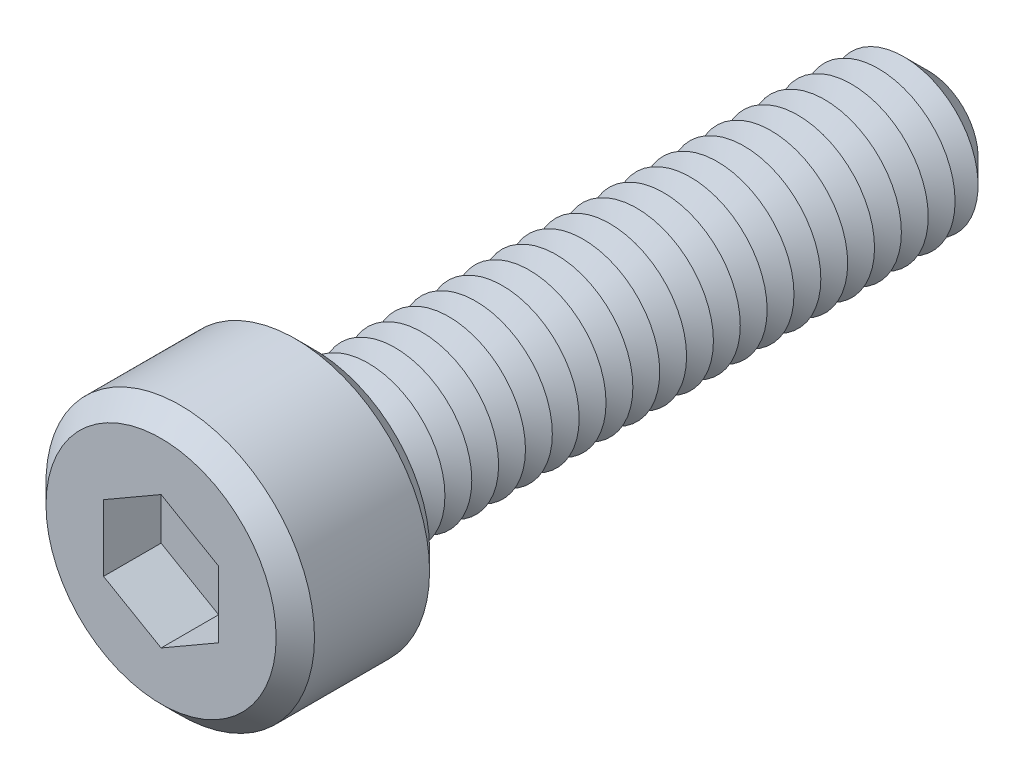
ISO-10303-21;
HEADER;
FILE_DESCRIPTION(('STEP AP214'),'2;1');
FILE_NAME('part.step','',(''),(''),'','','');
FILE_SCHEMA(('AUTOMOTIVE_DESIGN { 1 0 10303 214 1 1 1 1 }'));
ENDSEC;
DATA;
#1=APPLICATION_CONTEXT('core data for automotive mechanical design processes');
#2=APPLICATION_PROTOCOL_DEFINITION('international standard','automotive_design',2000,#1);
#3=PRODUCT_CONTEXT('',#1,'mechanical');
#4=PRODUCT('Part','Part','',(#3));
#5=PRODUCT_RELATED_PRODUCT_CATEGORY('part','',(#4));
#6=PRODUCT_DEFINITION_FORMATION('','',#4);
#7=PRODUCT_DEFINITION_CONTEXT('part definition',#1,'design');
#8=PRODUCT_DEFINITION('design','',#6,#7);
#9=PRODUCT_DEFINITION_SHAPE('','',#8);
#10=(LENGTH_UNIT() NAMED_UNIT(*) SI_UNIT(.MILLI.,.METRE.));
#11=(NAMED_UNIT(*) PLANE_ANGLE_UNIT() SI_UNIT($,.RADIAN.));
#12=(NAMED_UNIT(*) SI_UNIT($,.STERADIAN.) SOLID_ANGLE_UNIT());
#13=UNCERTAINTY_MEASURE_WITH_UNIT(LENGTH_MEASURE(1.E-05),#10,'distance_accuracy_value','');
#14=(GEOMETRIC_REPRESENTATION_CONTEXT(3) GLOBAL_UNCERTAINTY_ASSIGNED_CONTEXT((#13)) GLOBAL_UNIT_ASSIGNED_CONTEXT((#10,
#11,#12)) REPRESENTATION_CONTEXT('',''));
#15=CARTESIAN_POINT('',(0.,0.,0.));
#16=DIRECTION('',(0.,0.,1.));
#17=DIRECTION('',(1.,0.,0.));
#18=AXIS2_PLACEMENT_3D('',#15,#16,#17);
#19=CARTESIAN_POINT('',(0.,0.,4.));
#20=DIRECTION('',(0.,0.,-1.));
#21=DIRECTION('',(-1.,0.,0.));
#22=AXIS2_PLACEMENT_3D('',#19,#20,#21);
#23=CYLINDRICAL_SURFACE('',#22,3.5);
#24=CARTESIAN_POINT('',(0.,0.,0.5));
#25=DIRECTION('',(0.,0.,1.));
#26=DIRECTION('',(1.,0.,0.));
#27=AXIS2_PLACEMENT_3D('',#24,#25,#26);
#28=CIRCLE('',#27,3.5);
#29=CARTESIAN_POINT('',(3.5,0.,0.5));
#30=VERTEX_POINT('',#29);
#31=EDGE_CURVE('E352',#30,#30,#28,.T.);
#32=ORIENTED_EDGE('',*,*,#31,.T.);
#33=EDGE_LOOP('',(#32));
#34=FACE_BOUND('',#33,.T.);
#35=CARTESIAN_POINT('',(0.,0.,3.5));
#36=DIRECTION('',(0.,0.,1.));
#37=DIRECTION('',(1.,0.,0.));
#38=AXIS2_PLACEMENT_3D('',#35,#36,#37);
#39=CIRCLE('',#38,3.5);
#40=CARTESIAN_POINT('',(3.5,0.,3.5));
#41=VERTEX_POINT('',#40);
#42=EDGE_CURVE('E345',#41,#41,#39,.F.);
#43=ORIENTED_EDGE('',*,*,#42,.T.);
#44=EDGE_LOOP('',(#43));
#45=FACE_BOUND('',#44,.T.);
#46=ADVANCED_FACE('F39',(#34,#45),#23,.T.);
#47=CARTESIAN_POINT('',(0.,0.,4.));
#48=DIRECTION('',(0.,0.,1.));
#49=DIRECTION('',(1.,0.,0.));
#50=AXIS2_PLACEMENT_3D('',#47,#48,#49);
#51=PLANE('',#50);
#52=CARTESIAN_POINT('',(0.,0.,4.));
#53=DIRECTION('',(0.,0.,1.));
#54=DIRECTION('',(1.,0.,0.));
#55=AXIS2_PLACEMENT_3D('',#52,#53,#54);
#56=CIRCLE('',#55,3.);
#57=CARTESIAN_POINT('',(3.,0.,4.));
#58=VERTEX_POINT('',#57);
#59=EDGE_CURVE('E11',#58,#58,#56,.T.);
#60=ORIENTED_EDGE('',*,*,#59,.T.);
#61=EDGE_LOOP('',(#60));
#62=FACE_BOUND('',#61,.T.);
#63=DIRECTION('',(-0.866025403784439,0.5,0.));
#64=VECTOR('',#63,1.);
#65=CARTESIAN_POINT('',(1.5,0.866025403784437,4.));
#66=LINE('',#65,#64);
#67=CARTESIAN_POINT('',(1.5,0.866025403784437,4.));
#68=VERTEX_POINT('',#67);
#69=CARTESIAN_POINT('',(0.,1.73205080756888,4.));
#70=VERTEX_POINT('',#69);
#71=EDGE_CURVE('E55',#68,#70,#66,.T.);
#72=ORIENTED_EDGE('',*,*,#71,.F.);
#73=DIRECTION('',(0.,1.,0.));
#74=VECTOR('',#73,1.);
#75=CARTESIAN_POINT('',(1.5,-0.866025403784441,4.));
#76=LINE('',#75,#74);
#77=CARTESIAN_POINT('',(1.5,-0.866025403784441,4.));
#78=VERTEX_POINT('',#77);
#79=EDGE_CURVE('E151',#78,#68,#76,.T.);
#80=ORIENTED_EDGE('',*,*,#79,.F.);
#81=DIRECTION('',(0.866025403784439,0.5,0.));
#82=VECTOR('',#81,1.);
#83=CARTESIAN_POINT('',(0.,-1.73205080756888,4.));
#84=LINE('',#83,#82);
#85=CARTESIAN_POINT('',(0.,-1.73205080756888,4.));
#86=VERTEX_POINT('',#85);
#87=EDGE_CURVE('E148',#86,#78,#84,.T.);
#88=ORIENTED_EDGE('',*,*,#87,.F.);
#89=DIRECTION('',(0.866025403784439,-0.5,0.));
#90=VECTOR('',#89,1.);
#91=CARTESIAN_POINT('',(-1.5,-0.86602540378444,4.));
#92=LINE('',#91,#90);
#93=CARTESIAN_POINT('',(-1.5,-0.86602540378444,4.));
#94=VERTEX_POINT('',#93);
#95=EDGE_CURVE('E103',#94,#86,#92,.T.);
#96=ORIENTED_EDGE('',*,*,#95,.F.);
#97=DIRECTION('',(0.,-1.,0.));
#98=VECTOR('',#97,1.);
#99=CARTESIAN_POINT('',(-1.5,0.866025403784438,4.));
#100=LINE('',#99,#98);
#101=CARTESIAN_POINT('',(-1.5,0.866025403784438,4.));
#102=VERTEX_POINT('',#101);
#103=EDGE_CURVE('E142',#102,#94,#100,.T.);
#104=ORIENTED_EDGE('',*,*,#103,.F.);
#105=DIRECTION('',(-0.866025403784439,-0.5,0.));
#106=VECTOR('',#105,1.);
#107=CARTESIAN_POINT('',(0.,1.73205080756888,4.));
#108=LINE('',#107,#106);
#109=EDGE_CURVE('E137',#70,#102,#108,.T.);
#110=ORIENTED_EDGE('',*,*,#109,.F.);
#111=EDGE_LOOP('',(#72,#80,#88,#96,#104,#110));
#112=FACE_BOUND('',#111,.T.);
#113=ADVANCED_FACE('F370',(#62,#112),#51,.T.);
#114=CARTESIAN_POINT('',(0.,0.,0.));
#115=DIRECTION('',(0.,0.,1.));
#116=DIRECTION('',(1.,0.,0.));
#117=AXIS2_PLACEMENT_3D('',#114,#115,#116);
#118=PLANE('',#117);
#119=CARTESIAN_POINT('',(0.,0.,0.));
#120=DIRECTION('',(0.,0.,1.));
#121=DIRECTION('',(1.,0.,0.));
#122=AXIS2_PLACEMENT_3D('',#119,#120,#121);
#123=CIRCLE('',#122,3.);
#124=CARTESIAN_POINT('',(3.,0.,0.));
#125=VERTEX_POINT('',#124);
#126=EDGE_CURVE('E48',#125,#125,#123,.F.);
#127=ORIENTED_EDGE('',*,*,#126,.T.);
#128=EDGE_LOOP('',(#127));
#129=FACE_BOUND('',#128,.T.);
#130=CARTESIAN_POINT('',(0.,0.,0.));
#131=DIRECTION('',(0.,0.,1.));
#132=DIRECTION('',(1.,0.,0.));
#133=AXIS2_PLACEMENT_3D('',#130,#131,#132);
#134=CIRCLE('',#133,2.);
#135=CARTESIAN_POINT('',(2.,0.,0.));
#136=VERTEX_POINT('',#135);
#137=EDGE_CURVE('E337',#136,#136,#134,.T.);
#138=ORIENTED_EDGE('',*,*,#137,.T.);
#139=EDGE_LOOP('',(#138));
#140=FACE_BOUND('',#139,.T.);
#141=ADVANCED_FACE('F359',(#129,#140),#118,.F.);
#142=CARTESIAN_POINT('',(0.,0.,0.));
#143=DIRECTION('',(0.,0.,1.));
#144=DIRECTION('',(1.,0.,0.));
#145=AXIS2_PLACEMENT_3D('',#142,#143,#144);
#146=CONICAL_SURFACE('',#145,2.,1.0471975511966);
#147=CARTESIAN_POINT('',(0.,0.,-0.35));
#148=DIRECTION('',(0.,0.,1.));
#149=DIRECTION('',(1.,0.,0.));
#150=AXIS2_PLACEMENT_3D('',#147,#148,#149);
#151=CIRCLE('',#150,1.39378221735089);
#152=CARTESIAN_POINT('',(1.39378221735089,0.,-0.35));
#153=VERTEX_POINT('',#152);
#154=EDGE_CURVE('E333',#153,#153,#151,.T.);
#155=ORIENTED_EDGE('',*,*,#154,.T.);
#156=EDGE_LOOP('',(#155));
#157=FACE_BOUND('',#156,.T.);
#158=ORIENTED_EDGE('',*,*,#137,.F.);
#159=EDGE_LOOP('',(#158));
#160=FACE_BOUND('',#159,.T.);
#161=ADVANCED_FACE('F596',(#157,#160),#146,.T.);
#162=CARTESIAN_POINT('',(0.,0.,-0.35));
#163=DIRECTION('',(0.,0.,-1.));
#164=DIRECTION('',(-1.,0.,0.));
#165=AXIS2_PLACEMENT_3D('',#162,#163,#164);
#166=CONICAL_SURFACE('',#165,1.39378221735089,1.0471975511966);
#167=CARTESIAN_POINT('',(0.,0.,-0.7));
#168=DIRECTION('',(0.,0.,1.));
#169=DIRECTION('',(1.,0.,0.));
#170=AXIS2_PLACEMENT_3D('',#167,#168,#169);
#171=CIRCLE('',#170,2.);
#172=CARTESIAN_POINT('',(2.,0.,-0.7));
#173=VERTEX_POINT('',#172);
#174=EDGE_CURVE('E329',#173,#173,#171,.T.);
#175=ORIENTED_EDGE('',*,*,#174,.T.);
#176=EDGE_LOOP('',(#175));
#177=FACE_BOUND('',#176,.T.);
#178=ORIENTED_EDGE('',*,*,#154,.F.);
#179=EDGE_LOOP('',(#178));
#180=FACE_BOUND('',#179,.T.);
#181=ADVANCED_FACE('F592',(#177,#180),#166,.T.);
#182=CARTESIAN_POINT('',(0.,0.,-0.7));
#183=DIRECTION('',(0.,0.,1.));
#184=DIRECTION('',(1.,0.,0.));
#185=AXIS2_PLACEMENT_3D('',#182,#183,#184);
#186=CONICAL_SURFACE('',#185,2.,1.0471975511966);
#187=CARTESIAN_POINT('',(0.,0.,-1.05));
#188=DIRECTION('',(0.,0.,1.));
#189=DIRECTION('',(1.,0.,0.));
#190=AXIS2_PLACEMENT_3D('',#187,#188,#189);
#191=CIRCLE('',#190,1.39378221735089);
#192=CARTESIAN_POINT('',(1.39378221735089,0.,-1.05));
#193=VERTEX_POINT('',#192);
#194=EDGE_CURVE('E325',#193,#193,#191,.T.);
#195=ORIENTED_EDGE('',*,*,#194,.T.);
#196=EDGE_LOOP('',(#195));
#197=FACE_BOUND('',#196,.T.);
#198=ORIENTED_EDGE('',*,*,#174,.F.);
#199=EDGE_LOOP('',(#198));
#200=FACE_BOUND('',#199,.T.);
#201=ADVANCED_FACE('F588',(#197,#200),#186,.T.);
#202=CARTESIAN_POINT('',(0.,0.,-1.05));
#203=DIRECTION('',(0.,0.,-1.));
#204=DIRECTION('',(-1.,0.,0.));
#205=AXIS2_PLACEMENT_3D('',#202,#203,#204);
#206=CONICAL_SURFACE('',#205,1.39378221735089,1.0471975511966);
#207=CARTESIAN_POINT('',(0.,0.,-1.4));
#208=DIRECTION('',(0.,0.,1.));
#209=DIRECTION('',(1.,0.,0.));
#210=AXIS2_PLACEMENT_3D('',#207,#208,#209);
#211=CIRCLE('',#210,2.);
#212=CARTESIAN_POINT('',(2.,0.,-1.4));
#213=VERTEX_POINT('',#212);
#214=EDGE_CURVE('E321',#213,#213,#211,.T.);
#215=ORIENTED_EDGE('',*,*,#214,.T.);
#216=EDGE_LOOP('',(#215));
#217=FACE_BOUND('',#216,.T.);
#218=ORIENTED_EDGE('',*,*,#194,.F.);
#219=EDGE_LOOP('',(#218));
#220=FACE_BOUND('',#219,.T.);
#221=ADVANCED_FACE('F584',(#217,#220),#206,.T.);
#222=CARTESIAN_POINT('',(0.,0.,-1.4));
#223=DIRECTION('',(0.,0.,1.));
#224=DIRECTION('',(1.,0.,0.));
#225=AXIS2_PLACEMENT_3D('',#222,#223,#224);
#226=CONICAL_SURFACE('',#225,2.,1.0471975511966);
#227=CARTESIAN_POINT('',(0.,0.,-1.75));
#228=DIRECTION('',(0.,0.,1.));
#229=DIRECTION('',(1.,0.,0.));
#230=AXIS2_PLACEMENT_3D('',#227,#228,#229);
#231=CIRCLE('',#230,1.39378221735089);
#232=CARTESIAN_POINT('',(1.39378221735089,0.,-1.75));
#233=VERTEX_POINT('',#232);
#234=EDGE_CURVE('E317',#233,#233,#231,.T.);
#235=ORIENTED_EDGE('',*,*,#234,.T.);
#236=EDGE_LOOP('',(#235));
#237=FACE_BOUND('',#236,.T.);
#238=ORIENTED_EDGE('',*,*,#214,.F.);
#239=EDGE_LOOP('',(#238));
#240=FACE_BOUND('',#239,.T.);
#241=ADVANCED_FACE('F580',(#237,#240),#226,.T.);
#242=CARTESIAN_POINT('',(0.,0.,-1.75));
#243=DIRECTION('',(0.,0.,-1.));
#244=DIRECTION('',(-1.,0.,0.));
#245=AXIS2_PLACEMENT_3D('',#242,#243,#244);
#246=CONICAL_SURFACE('',#245,1.39378221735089,1.0471975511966);
#247=CARTESIAN_POINT('',(0.,0.,-2.1));
#248=DIRECTION('',(0.,0.,1.));
#249=DIRECTION('',(1.,0.,0.));
#250=AXIS2_PLACEMENT_3D('',#247,#248,#249);
#251=CIRCLE('',#250,2.);
#252=CARTESIAN_POINT('',(2.,0.,-2.1));
#253=VERTEX_POINT('',#252);
#254=EDGE_CURVE('E314',#253,#253,#251,.T.);
#255=ORIENTED_EDGE('',*,*,#254,.T.);
#256=EDGE_LOOP('',(#255));
#257=FACE_BOUND('',#256,.T.);
#258=ORIENTED_EDGE('',*,*,#234,.F.);
#259=EDGE_LOOP('',(#258));
#260=FACE_BOUND('',#259,.T.);
#261=ADVANCED_FACE('F576',(#257,#260),#246,.T.);
#262=CARTESIAN_POINT('',(0.,0.,-2.1));
#263=DIRECTION('',(0.,0.,1.));
#264=DIRECTION('',(1.,0.,0.));
#265=AXIS2_PLACEMENT_3D('',#262,#263,#264);
#266=CONICAL_SURFACE('',#265,2.,1.0471975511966);
#267=CARTESIAN_POINT('',(0.,0.,-2.45));
#268=DIRECTION('',(0.,0.,1.));
#269=DIRECTION('',(1.,0.,0.));
#270=AXIS2_PLACEMENT_3D('',#267,#268,#269);
#271=CIRCLE('',#270,1.39378221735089);
#272=CARTESIAN_POINT('',(1.39378221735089,0.,-2.45));
#273=VERTEX_POINT('',#272);
#274=EDGE_CURVE('E310',#273,#273,#271,.T.);
#275=ORIENTED_EDGE('',*,*,#274,.T.);
#276=EDGE_LOOP('',(#275));
#277=FACE_BOUND('',#276,.T.);
#278=ORIENTED_EDGE('',*,*,#254,.F.);
#279=EDGE_LOOP('',(#278));
#280=FACE_BOUND('',#279,.T.);
#281=ADVANCED_FACE('F572',(#277,#280),#266,.T.);
#282=CARTESIAN_POINT('',(0.,0.,-2.45));
#283=DIRECTION('',(0.,0.,-1.));
#284=DIRECTION('',(-1.,0.,0.));
#285=AXIS2_PLACEMENT_3D('',#282,#283,#284);
#286=CONICAL_SURFACE('',#285,1.39378221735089,1.0471975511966);
#287=CARTESIAN_POINT('',(0.,0.,-2.8));
#288=DIRECTION('',(0.,0.,1.));
#289=DIRECTION('',(1.,0.,0.));
#290=AXIS2_PLACEMENT_3D('',#287,#288,#289);
#291=CIRCLE('',#290,2.);
#292=CARTESIAN_POINT('',(2.,0.,-2.8));
#293=VERTEX_POINT('',#292);
#294=EDGE_CURVE('E306',#293,#293,#291,.T.);
#295=ORIENTED_EDGE('',*,*,#294,.T.);
#296=EDGE_LOOP('',(#295));
#297=FACE_BOUND('',#296,.T.);
#298=ORIENTED_EDGE('',*,*,#274,.F.);
#299=EDGE_LOOP('',(#298));
#300=FACE_BOUND('',#299,.T.);
#301=ADVANCED_FACE('F568',(#297,#300),#286,.T.);
#302=CARTESIAN_POINT('',(0.,0.,-2.8));
#303=DIRECTION('',(0.,0.,1.));
#304=DIRECTION('',(1.,0.,0.));
#305=AXIS2_PLACEMENT_3D('',#302,#303,#304);
#306=CONICAL_SURFACE('',#305,2.,1.0471975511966);
#307=CARTESIAN_POINT('',(0.,0.,-3.15));
#308=DIRECTION('',(0.,0.,1.));
#309=DIRECTION('',(1.,0.,0.));
#310=AXIS2_PLACEMENT_3D('',#307,#308,#309);
#311=CIRCLE('',#310,1.39378221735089);
#312=CARTESIAN_POINT('',(1.39378221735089,0.,-3.15));
#313=VERTEX_POINT('',#312);
#314=EDGE_CURVE('E302',#313,#313,#311,.T.);
#315=ORIENTED_EDGE('',*,*,#314,.T.);
#316=EDGE_LOOP('',(#315));
#317=FACE_BOUND('',#316,.T.);
#318=ORIENTED_EDGE('',*,*,#294,.F.);
#319=EDGE_LOOP('',(#318));
#320=FACE_BOUND('',#319,.T.);
#321=ADVANCED_FACE('F564',(#317,#320),#306,.T.);
#322=CARTESIAN_POINT('',(0.,0.,-3.15));
#323=DIRECTION('',(0.,0.,-1.));
#324=DIRECTION('',(-1.,0.,0.));
#325=AXIS2_PLACEMENT_3D('',#322,#323,#324);
#326=CONICAL_SURFACE('',#325,1.39378221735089,1.0471975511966);
#327=CARTESIAN_POINT('',(0.,0.,-3.5));
#328=DIRECTION('',(0.,0.,1.));
#329=DIRECTION('',(1.,0.,0.));
#330=AXIS2_PLACEMENT_3D('',#327,#328,#329);
#331=CIRCLE('',#330,2.);
#332=CARTESIAN_POINT('',(2.,0.,-3.5));
#333=VERTEX_POINT('',#332);
#334=EDGE_CURVE('E298',#333,#333,#331,.T.);
#335=ORIENTED_EDGE('',*,*,#334,.T.);
#336=EDGE_LOOP('',(#335));
#337=FACE_BOUND('',#336,.T.);
#338=ORIENTED_EDGE('',*,*,#314,.F.);
#339=EDGE_LOOP('',(#338));
#340=FACE_BOUND('',#339,.T.);
#341=ADVANCED_FACE('F560',(#337,#340),#326,.T.);
#342=CARTESIAN_POINT('',(0.,0.,-3.5));
#343=DIRECTION('',(0.,0.,1.));
#344=DIRECTION('',(1.,0.,0.));
#345=AXIS2_PLACEMENT_3D('',#342,#343,#344);
#346=CONICAL_SURFACE('',#345,2.,1.0471975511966);
#347=CARTESIAN_POINT('',(0.,0.,-3.85));
#348=DIRECTION('',(0.,0.,1.));
#349=DIRECTION('',(1.,0.,0.));
#350=AXIS2_PLACEMENT_3D('',#347,#348,#349);
#351=CIRCLE('',#350,1.39378221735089);
#352=CARTESIAN_POINT('',(1.39378221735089,0.,-3.85));
#353=VERTEX_POINT('',#352);
#354=EDGE_CURVE('E294',#353,#353,#351,.T.);
#355=ORIENTED_EDGE('',*,*,#354,.T.);
#356=EDGE_LOOP('',(#355));
#357=FACE_BOUND('',#356,.T.);
#358=ORIENTED_EDGE('',*,*,#334,.F.);
#359=EDGE_LOOP('',(#358));
#360=FACE_BOUND('',#359,.T.);
#361=ADVANCED_FACE('F556',(#357,#360),#346,.T.);
#362=CARTESIAN_POINT('',(0.,0.,-3.85));
#363=DIRECTION('',(0.,0.,-1.));
#364=DIRECTION('',(-1.,0.,0.));
#365=AXIS2_PLACEMENT_3D('',#362,#363,#364);
#366=CONICAL_SURFACE('',#365,1.39378221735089,1.0471975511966);
#367=CARTESIAN_POINT('',(0.,0.,-4.2));
#368=DIRECTION('',(0.,0.,1.));
#369=DIRECTION('',(1.,0.,0.));
#370=AXIS2_PLACEMENT_3D('',#367,#368,#369);
#371=CIRCLE('',#370,2.);
#372=CARTESIAN_POINT('',(2.,0.,-4.2));
#373=VERTEX_POINT('',#372);
#374=EDGE_CURVE('E290',#373,#373,#371,.T.);
#375=ORIENTED_EDGE('',*,*,#374,.T.);
#376=EDGE_LOOP('',(#375));
#377=FACE_BOUND('',#376,.T.);
#378=ORIENTED_EDGE('',*,*,#354,.F.);
#379=EDGE_LOOP('',(#378));
#380=FACE_BOUND('',#379,.T.);
#381=ADVANCED_FACE('F552',(#377,#380),#366,.T.);
#382=CARTESIAN_POINT('',(0.,0.,-4.2));
#383=DIRECTION('',(0.,0.,1.));
#384=DIRECTION('',(1.,0.,0.));
#385=AXIS2_PLACEMENT_3D('',#382,#383,#384);
#386=CONICAL_SURFACE('',#385,2.,1.0471975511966);
#387=CARTESIAN_POINT('',(0.,0.,-4.55));
#388=DIRECTION('',(0.,0.,1.));
#389=DIRECTION('',(1.,0.,0.));
#390=AXIS2_PLACEMENT_3D('',#387,#388,#389);
#391=CIRCLE('',#390,1.39378221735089);
#392=CARTESIAN_POINT('',(1.39378221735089,0.,-4.55));
#393=VERTEX_POINT('',#392);
#394=EDGE_CURVE('E286',#393,#393,#391,.T.);
#395=ORIENTED_EDGE('',*,*,#394,.T.);
#396=EDGE_LOOP('',(#395));
#397=FACE_BOUND('',#396,.T.);
#398=ORIENTED_EDGE('',*,*,#374,.F.);
#399=EDGE_LOOP('',(#398));
#400=FACE_BOUND('',#399,.T.);
#401=ADVANCED_FACE('F548',(#397,#400),#386,.T.);
#402=CARTESIAN_POINT('',(0.,0.,-4.55));
#403=DIRECTION('',(0.,0.,-1.));
#404=DIRECTION('',(-1.,0.,0.));
#405=AXIS2_PLACEMENT_3D('',#402,#403,#404);
#406=CONICAL_SURFACE('',#405,1.39378221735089,1.0471975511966);
#407=CARTESIAN_POINT('',(0.,0.,-4.9));
#408=DIRECTION('',(0.,0.,1.));
#409=DIRECTION('',(1.,0.,0.));
#410=AXIS2_PLACEMENT_3D('',#407,#408,#409);
#411=CIRCLE('',#410,2.);
#412=CARTESIAN_POINT('',(2.,0.,-4.9));
#413=VERTEX_POINT('',#412);
#414=EDGE_CURVE('E282',#413,#413,#411,.T.);
#415=ORIENTED_EDGE('',*,*,#414,.T.);
#416=EDGE_LOOP('',(#415));
#417=FACE_BOUND('',#416,.T.);
#418=ORIENTED_EDGE('',*,*,#394,.F.);
#419=EDGE_LOOP('',(#418));
#420=FACE_BOUND('',#419,.T.);
#421=ADVANCED_FACE('F544',(#417,#420),#406,.T.);
#422=CARTESIAN_POINT('',(0.,0.,-4.9));
#423=DIRECTION('',(0.,0.,1.));
#424=DIRECTION('',(1.,0.,0.));
#425=AXIS2_PLACEMENT_3D('',#422,#423,#424);
#426=CONICAL_SURFACE('',#425,2.,1.0471975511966);
#427=CARTESIAN_POINT('',(0.,0.,-5.25));
#428=DIRECTION('',(0.,0.,1.));
#429=DIRECTION('',(1.,0.,0.));
#430=AXIS2_PLACEMENT_3D('',#427,#428,#429);
#431=CIRCLE('',#430,1.39378221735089);
#432=CARTESIAN_POINT('',(1.39378221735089,0.,-5.25));
#433=VERTEX_POINT('',#432);
#434=EDGE_CURVE('E278',#433,#433,#431,.T.);
#435=ORIENTED_EDGE('',*,*,#434,.T.);
#436=EDGE_LOOP('',(#435));
#437=FACE_BOUND('',#436,.T.);
#438=ORIENTED_EDGE('',*,*,#414,.F.);
#439=EDGE_LOOP('',(#438));
#440=FACE_BOUND('',#439,.T.);
#441=ADVANCED_FACE('F540',(#437,#440),#426,.T.);
#442=CARTESIAN_POINT('',(0.,0.,-5.25));
#443=DIRECTION('',(0.,0.,-1.));
#444=DIRECTION('',(-1.,0.,0.));
#445=AXIS2_PLACEMENT_3D('',#442,#443,#444);
#446=CONICAL_SURFACE('',#445,1.39378221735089,1.0471975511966);
#447=CARTESIAN_POINT('',(0.,0.,-5.6));
#448=DIRECTION('',(0.,0.,1.));
#449=DIRECTION('',(1.,0.,0.));
#450=AXIS2_PLACEMENT_3D('',#447,#448,#449);
#451=CIRCLE('',#450,2.);
#452=CARTESIAN_POINT('',(2.,0.,-5.6));
#453=VERTEX_POINT('',#452);
#454=EDGE_CURVE('E274',#453,#453,#451,.T.);
#455=ORIENTED_EDGE('',*,*,#454,.T.);
#456=EDGE_LOOP('',(#455));
#457=FACE_BOUND('',#456,.T.);
#458=ORIENTED_EDGE('',*,*,#434,.F.);
#459=EDGE_LOOP('',(#458));
#460=FACE_BOUND('',#459,.T.);
#461=ADVANCED_FACE('F536',(#457,#460),#446,.T.);
#462=CARTESIAN_POINT('',(0.,0.,-5.6));
#463=DIRECTION('',(0.,0.,1.));
#464=DIRECTION('',(1.,0.,0.));
#465=AXIS2_PLACEMENT_3D('',#462,#463,#464);
#466=CONICAL_SURFACE('',#465,2.,1.0471975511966);
#467=CARTESIAN_POINT('',(0.,0.,-5.95));
#468=DIRECTION('',(0.,0.,1.));
#469=DIRECTION('',(1.,0.,0.));
#470=AXIS2_PLACEMENT_3D('',#467,#468,#469);
#471=CIRCLE('',#470,1.39378221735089);
#472=CARTESIAN_POINT('',(1.39378221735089,0.,-5.95));
#473=VERTEX_POINT('',#472);
#474=EDGE_CURVE('E270',#473,#473,#471,.T.);
#475=ORIENTED_EDGE('',*,*,#474,.T.);
#476=EDGE_LOOP('',(#475));
#477=FACE_BOUND('',#476,.T.);
#478=ORIENTED_EDGE('',*,*,#454,.F.);
#479=EDGE_LOOP('',(#478));
#480=FACE_BOUND('',#479,.T.);
#481=ADVANCED_FACE('F532',(#477,#480),#466,.T.);
#482=CARTESIAN_POINT('',(0.,0.,-5.95));
#483=DIRECTION('',(0.,0.,-1.));
#484=DIRECTION('',(-1.,0.,0.));
#485=AXIS2_PLACEMENT_3D('',#482,#483,#484);
#486=CONICAL_SURFACE('',#485,1.39378221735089,1.0471975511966);
#487=CARTESIAN_POINT('',(0.,0.,-6.3));
#488=DIRECTION('',(0.,0.,1.));
#489=DIRECTION('',(1.,0.,0.));
#490=AXIS2_PLACEMENT_3D('',#487,#488,#489);
#491=CIRCLE('',#490,2.);
#492=CARTESIAN_POINT('',(2.,0.,-6.3));
#493=VERTEX_POINT('',#492);
#494=EDGE_CURVE('E266',#493,#493,#491,.T.);
#495=ORIENTED_EDGE('',*,*,#494,.T.);
#496=EDGE_LOOP('',(#495));
#497=FACE_BOUND('',#496,.T.);
#498=ORIENTED_EDGE('',*,*,#474,.F.);
#499=EDGE_LOOP('',(#498));
#500=FACE_BOUND('',#499,.T.);
#501=ADVANCED_FACE('F528',(#497,#500),#486,.T.);
#502=CARTESIAN_POINT('',(0.,0.,-6.3));
#503=DIRECTION('',(0.,0.,1.));
#504=DIRECTION('',(1.,0.,0.));
#505=AXIS2_PLACEMENT_3D('',#502,#503,#504);
#506=CONICAL_SURFACE('',#505,2.,1.0471975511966);
#507=CARTESIAN_POINT('',(0.,0.,-6.65));
#508=DIRECTION('',(0.,0.,1.));
#509=DIRECTION('',(1.,0.,0.));
#510=AXIS2_PLACEMENT_3D('',#507,#508,#509);
#511=CIRCLE('',#510,1.39378221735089);
#512=CARTESIAN_POINT('',(1.39378221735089,0.,-6.65));
#513=VERTEX_POINT('',#512);
#514=EDGE_CURVE('E262',#513,#513,#511,.T.);
#515=ORIENTED_EDGE('',*,*,#514,.T.);
#516=EDGE_LOOP('',(#515));
#517=FACE_BOUND('',#516,.T.);
#518=ORIENTED_EDGE('',*,*,#494,.F.);
#519=EDGE_LOOP('',(#518));
#520=FACE_BOUND('',#519,.T.);
#521=ADVANCED_FACE('F524',(#517,#520),#506,.T.);
#522=CARTESIAN_POINT('',(0.,0.,-6.65));
#523=DIRECTION('',(0.,0.,-1.));
#524=DIRECTION('',(-1.,0.,0.));
#525=AXIS2_PLACEMENT_3D('',#522,#523,#524);
#526=CONICAL_SURFACE('',#525,1.39378221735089,1.0471975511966);
#527=CARTESIAN_POINT('',(0.,0.,-7.));
#528=DIRECTION('',(0.,0.,1.));
#529=DIRECTION('',(1.,0.,0.));
#530=AXIS2_PLACEMENT_3D('',#527,#528,#529);
#531=CIRCLE('',#530,2.);
#532=CARTESIAN_POINT('',(2.,0.,-7.));
#533=VERTEX_POINT('',#532);
#534=EDGE_CURVE('E258',#533,#533,#531,.T.);
#535=ORIENTED_EDGE('',*,*,#534,.T.);
#536=EDGE_LOOP('',(#535));
#537=FACE_BOUND('',#536,.T.);
#538=ORIENTED_EDGE('',*,*,#514,.F.);
#539=EDGE_LOOP('',(#538));
#540=FACE_BOUND('',#539,.T.);
#541=ADVANCED_FACE('F520',(#537,#540),#526,.T.);
#542=CARTESIAN_POINT('',(0.,0.,-7.));
#543=DIRECTION('',(0.,0.,1.));
#544=DIRECTION('',(1.,0.,0.));
#545=AXIS2_PLACEMENT_3D('',#542,#543,#544);
#546=CONICAL_SURFACE('',#545,2.,1.0471975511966);
#547=CARTESIAN_POINT('',(0.,0.,-7.35));
#548=DIRECTION('',(0.,0.,1.));
#549=DIRECTION('',(1.,0.,0.));
#550=AXIS2_PLACEMENT_3D('',#547,#548,#549);
#551=CIRCLE('',#550,1.39378221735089);
#552=CARTESIAN_POINT('',(1.39378221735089,0.,-7.35));
#553=VERTEX_POINT('',#552);
#554=EDGE_CURVE('E254',#553,#553,#551,.T.);
#555=ORIENTED_EDGE('',*,*,#554,.T.);
#556=EDGE_LOOP('',(#555));
#557=FACE_BOUND('',#556,.T.);
#558=ORIENTED_EDGE('',*,*,#534,.F.);
#559=EDGE_LOOP('',(#558));
#560=FACE_BOUND('',#559,.T.);
#561=ADVANCED_FACE('F516',(#557,#560),#546,.T.);
#562=CARTESIAN_POINT('',(0.,0.,-7.35));
#563=DIRECTION('',(0.,0.,-1.));
#564=DIRECTION('',(-1.,0.,0.));
#565=AXIS2_PLACEMENT_3D('',#562,#563,#564);
#566=CONICAL_SURFACE('',#565,1.39378221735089,1.0471975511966);
#567=CARTESIAN_POINT('',(0.,0.,-7.7));
#568=DIRECTION('',(0.,0.,1.));
#569=DIRECTION('',(1.,0.,0.));
#570=AXIS2_PLACEMENT_3D('',#567,#568,#569);
#571=CIRCLE('',#570,2.);
#572=CARTESIAN_POINT('',(2.,0.,-7.7));
#573=VERTEX_POINT('',#572);
#574=EDGE_CURVE('E250',#573,#573,#571,.T.);
#575=ORIENTED_EDGE('',*,*,#574,.T.);
#576=EDGE_LOOP('',(#575));
#577=FACE_BOUND('',#576,.T.);
#578=ORIENTED_EDGE('',*,*,#554,.F.);
#579=EDGE_LOOP('',(#578));
#580=FACE_BOUND('',#579,.T.);
#581=ADVANCED_FACE('F512',(#577,#580),#566,.T.);
#582=CARTESIAN_POINT('',(0.,0.,-7.7));
#583=DIRECTION('',(0.,0.,1.));
#584=DIRECTION('',(1.,0.,0.));
#585=AXIS2_PLACEMENT_3D('',#582,#583,#584);
#586=CONICAL_SURFACE('',#585,2.,1.0471975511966);
#587=CARTESIAN_POINT('',(0.,0.,-8.05));
#588=DIRECTION('',(0.,0.,1.));
#589=DIRECTION('',(1.,0.,0.));
#590=AXIS2_PLACEMENT_3D('',#587,#588,#589);
#591=CIRCLE('',#590,1.39378221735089);
#592=CARTESIAN_POINT('',(1.39378221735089,0.,-8.05));
#593=VERTEX_POINT('',#592);
#594=EDGE_CURVE('E246',#593,#593,#591,.T.);
#595=ORIENTED_EDGE('',*,*,#594,.T.);
#596=EDGE_LOOP('',(#595));
#597=FACE_BOUND('',#596,.T.);
#598=ORIENTED_EDGE('',*,*,#574,.F.);
#599=EDGE_LOOP('',(#598));
#600=FACE_BOUND('',#599,.T.);
#601=ADVANCED_FACE('F508',(#597,#600),#586,.T.);
#602=CARTESIAN_POINT('',(0.,0.,-8.05));
#603=DIRECTION('',(0.,0.,-1.));
#604=DIRECTION('',(-1.,0.,0.));
#605=AXIS2_PLACEMENT_3D('',#602,#603,#604);
#606=CONICAL_SURFACE('',#605,1.39378221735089,1.0471975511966);
#607=CARTESIAN_POINT('',(0.,0.,-8.4));
#608=DIRECTION('',(0.,0.,1.));
#609=DIRECTION('',(1.,0.,0.));
#610=AXIS2_PLACEMENT_3D('',#607,#608,#609);
#611=CIRCLE('',#610,2.);
#612=CARTESIAN_POINT('',(2.,0.,-8.4));
#613=VERTEX_POINT('',#612);
#614=EDGE_CURVE('E242',#613,#613,#611,.T.);
#615=ORIENTED_EDGE('',*,*,#614,.T.);
#616=EDGE_LOOP('',(#615));
#617=FACE_BOUND('',#616,.T.);
#618=ORIENTED_EDGE('',*,*,#594,.F.);
#619=EDGE_LOOP('',(#618));
#620=FACE_BOUND('',#619,.T.);
#621=ADVANCED_FACE('F504',(#617,#620),#606,.T.);
#622=CARTESIAN_POINT('',(0.,0.,-8.4));
#623=DIRECTION('',(0.,0.,1.));
#624=DIRECTION('',(1.,0.,0.));
#625=AXIS2_PLACEMENT_3D('',#622,#623,#624);
#626=CONICAL_SURFACE('',#625,2.,1.0471975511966);
#627=CARTESIAN_POINT('',(0.,0.,-8.75));
#628=DIRECTION('',(0.,0.,1.));
#629=DIRECTION('',(1.,0.,0.));
#630=AXIS2_PLACEMENT_3D('',#627,#628,#629);
#631=CIRCLE('',#630,1.39378221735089);
#632=CARTESIAN_POINT('',(1.39378221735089,0.,-8.75));
#633=VERTEX_POINT('',#632);
#634=EDGE_CURVE('E238',#633,#633,#631,.T.);
#635=ORIENTED_EDGE('',*,*,#634,.T.);
#636=EDGE_LOOP('',(#635));
#637=FACE_BOUND('',#636,.T.);
#638=ORIENTED_EDGE('',*,*,#614,.F.);
#639=EDGE_LOOP('',(#638));
#640=FACE_BOUND('',#639,.T.);
#641=ADVANCED_FACE('F500',(#637,#640),#626,.T.);
#642=CARTESIAN_POINT('',(0.,0.,-8.75));
#643=DIRECTION('',(0.,0.,-1.));
#644=DIRECTION('',(-1.,0.,0.));
#645=AXIS2_PLACEMENT_3D('',#642,#643,#644);
#646=CONICAL_SURFACE('',#645,1.39378221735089,1.0471975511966);
#647=CARTESIAN_POINT('',(0.,0.,-9.1));
#648=DIRECTION('',(0.,0.,1.));
#649=DIRECTION('',(1.,0.,0.));
#650=AXIS2_PLACEMENT_3D('',#647,#648,#649);
#651=CIRCLE('',#650,2.);
#652=CARTESIAN_POINT('',(2.,0.,-9.1));
#653=VERTEX_POINT('',#652);
#654=EDGE_CURVE('E234',#653,#653,#651,.T.);
#655=ORIENTED_EDGE('',*,*,#654,.T.);
#656=EDGE_LOOP('',(#655));
#657=FACE_BOUND('',#656,.T.);
#658=ORIENTED_EDGE('',*,*,#634,.F.);
#659=EDGE_LOOP('',(#658));
#660=FACE_BOUND('',#659,.T.);
#661=ADVANCED_FACE('F496',(#657,#660),#646,.T.);
#662=CARTESIAN_POINT('',(0.,0.,-9.1));
#663=DIRECTION('',(0.,0.,1.));
#664=DIRECTION('',(1.,0.,0.));
#665=AXIS2_PLACEMENT_3D('',#662,#663,#664);
#666=CONICAL_SURFACE('',#665,2.,1.0471975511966);
#667=CARTESIAN_POINT('',(0.,0.,-9.45));
#668=DIRECTION('',(0.,0.,1.));
#669=DIRECTION('',(1.,0.,0.));
#670=AXIS2_PLACEMENT_3D('',#667,#668,#669);
#671=CIRCLE('',#670,1.39378221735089);
#672=CARTESIAN_POINT('',(1.39378221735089,0.,-9.45));
#673=VERTEX_POINT('',#672);
#674=EDGE_CURVE('E230',#673,#673,#671,.T.);
#675=ORIENTED_EDGE('',*,*,#674,.T.);
#676=EDGE_LOOP('',(#675));
#677=FACE_BOUND('',#676,.T.);
#678=ORIENTED_EDGE('',*,*,#654,.F.);
#679=EDGE_LOOP('',(#678));
#680=FACE_BOUND('',#679,.T.);
#681=ADVANCED_FACE('F492',(#677,#680),#666,.T.);
#682=CARTESIAN_POINT('',(0.,0.,-9.45));
#683=DIRECTION('',(0.,0.,-1.));
#684=DIRECTION('',(-1.,0.,0.));
#685=AXIS2_PLACEMENT_3D('',#682,#683,#684);
#686=CONICAL_SURFACE('',#685,1.39378221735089,1.0471975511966);
#687=CARTESIAN_POINT('',(0.,0.,-9.8));
#688=DIRECTION('',(0.,0.,1.));
#689=DIRECTION('',(1.,0.,0.));
#690=AXIS2_PLACEMENT_3D('',#687,#688,#689);
#691=CIRCLE('',#690,2.);
#692=CARTESIAN_POINT('',(2.,0.,-9.8));
#693=VERTEX_POINT('',#692);
#694=EDGE_CURVE('E226',#693,#693,#691,.T.);
#695=ORIENTED_EDGE('',*,*,#694,.T.);
#696=EDGE_LOOP('',(#695));
#697=FACE_BOUND('',#696,.T.);
#698=ORIENTED_EDGE('',*,*,#674,.F.);
#699=EDGE_LOOP('',(#698));
#700=FACE_BOUND('',#699,.T.);
#701=ADVANCED_FACE('F488',(#697,#700),#686,.T.);
#702=CARTESIAN_POINT('',(0.,0.,-9.8));
#703=DIRECTION('',(0.,0.,1.));
#704=DIRECTION('',(1.,0.,0.));
#705=AXIS2_PLACEMENT_3D('',#702,#703,#704);
#706=CONICAL_SURFACE('',#705,2.,1.0471975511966);
#707=CARTESIAN_POINT('',(0.,0.,-10.15));
#708=DIRECTION('',(0.,0.,1.));
#709=DIRECTION('',(1.,0.,0.));
#710=AXIS2_PLACEMENT_3D('',#707,#708,#709);
#711=CIRCLE('',#710,1.39378221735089);
#712=CARTESIAN_POINT('',(1.39378221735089,0.,-10.15));
#713=VERTEX_POINT('',#712);
#714=EDGE_CURVE('E222',#713,#713,#711,.T.);
#715=ORIENTED_EDGE('',*,*,#714,.T.);
#716=EDGE_LOOP('',(#715));
#717=FACE_BOUND('',#716,.T.);
#718=ORIENTED_EDGE('',*,*,#694,.F.);
#719=EDGE_LOOP('',(#718));
#720=FACE_BOUND('',#719,.T.);
#721=ADVANCED_FACE('F484',(#717,#720),#706,.T.);
#722=CARTESIAN_POINT('',(0.,0.,-10.15));
#723=DIRECTION('',(0.,0.,-1.));
#724=DIRECTION('',(-1.,0.,0.));
#725=AXIS2_PLACEMENT_3D('',#722,#723,#724);
#726=CONICAL_SURFACE('',#725,1.39378221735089,1.0471975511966);
#727=CARTESIAN_POINT('',(0.,0.,-10.5));
#728=DIRECTION('',(0.,0.,1.));
#729=DIRECTION('',(1.,0.,0.));
#730=AXIS2_PLACEMENT_3D('',#727,#728,#729);
#731=CIRCLE('',#730,2.);
#732=CARTESIAN_POINT('',(2.,0.,-10.5));
#733=VERTEX_POINT('',#732);
#734=EDGE_CURVE('E218',#733,#733,#731,.T.);
#735=ORIENTED_EDGE('',*,*,#734,.T.);
#736=EDGE_LOOP('',(#735));
#737=FACE_BOUND('',#736,.T.);
#738=ORIENTED_EDGE('',*,*,#714,.F.);
#739=EDGE_LOOP('',(#738));
#740=FACE_BOUND('',#739,.T.);
#741=ADVANCED_FACE('F480',(#737,#740),#726,.T.);
#742=CARTESIAN_POINT('',(0.,0.,-10.5));
#743=DIRECTION('',(0.,0.,1.));
#744=DIRECTION('',(1.,0.,0.));
#745=AXIS2_PLACEMENT_3D('',#742,#743,#744);
#746=CONICAL_SURFACE('',#745,2.,1.0471975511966);
#747=CARTESIAN_POINT('',(0.,0.,-10.85));
#748=DIRECTION('',(0.,0.,1.));
#749=DIRECTION('',(1.,0.,0.));
#750=AXIS2_PLACEMENT_3D('',#747,#748,#749);
#751=CIRCLE('',#750,1.39378221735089);
#752=CARTESIAN_POINT('',(1.39378221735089,0.,-10.85));
#753=VERTEX_POINT('',#752);
#754=EDGE_CURVE('E214',#753,#753,#751,.T.);
#755=ORIENTED_EDGE('',*,*,#754,.T.);
#756=EDGE_LOOP('',(#755));
#757=FACE_BOUND('',#756,.T.);
#758=ORIENTED_EDGE('',*,*,#734,.F.);
#759=EDGE_LOOP('',(#758));
#760=FACE_BOUND('',#759,.T.);
#761=ADVANCED_FACE('F476',(#757,#760),#746,.T.);
#762=CARTESIAN_POINT('',(0.,0.,-10.85));
#763=DIRECTION('',(0.,0.,-1.));
#764=DIRECTION('',(-1.,0.,0.));
#765=AXIS2_PLACEMENT_3D('',#762,#763,#764);
#766=CONICAL_SURFACE('',#765,1.39378221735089,1.0471975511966);
#767=CARTESIAN_POINT('',(0.,0.,-11.2));
#768=DIRECTION('',(0.,0.,1.));
#769=DIRECTION('',(1.,0.,0.));
#770=AXIS2_PLACEMENT_3D('',#767,#768,#769);
#771=CIRCLE('',#770,2.);
#772=CARTESIAN_POINT('',(2.,0.,-11.2));
#773=VERTEX_POINT('',#772);
#774=EDGE_CURVE('E210',#773,#773,#771,.T.);
#775=ORIENTED_EDGE('',*,*,#774,.T.);
#776=EDGE_LOOP('',(#775));
#777=FACE_BOUND('',#776,.T.);
#778=ORIENTED_EDGE('',*,*,#754,.F.);
#779=EDGE_LOOP('',(#778));
#780=FACE_BOUND('',#779,.T.);
#781=ADVANCED_FACE('F472',(#777,#780),#766,.T.);
#782=CARTESIAN_POINT('',(0.,0.,-11.2));
#783=DIRECTION('',(0.,0.,1.));
#784=DIRECTION('',(1.,0.,0.));
#785=AXIS2_PLACEMENT_3D('',#782,#783,#784);
#786=CONICAL_SURFACE('',#785,2.,1.0471975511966);
#787=CARTESIAN_POINT('',(0.,0.,-11.55));
#788=DIRECTION('',(0.,0.,1.));
#789=DIRECTION('',(1.,0.,0.));
#790=AXIS2_PLACEMENT_3D('',#787,#788,#789);
#791=CIRCLE('',#790,1.39378221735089);
#792=CARTESIAN_POINT('',(1.39378221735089,0.,-11.55));
#793=VERTEX_POINT('',#792);
#794=EDGE_CURVE('E206',#793,#793,#791,.T.);
#795=ORIENTED_EDGE('',*,*,#794,.T.);
#796=EDGE_LOOP('',(#795));
#797=FACE_BOUND('',#796,.T.);
#798=ORIENTED_EDGE('',*,*,#774,.F.);
#799=EDGE_LOOP('',(#798));
#800=FACE_BOUND('',#799,.T.);
#801=ADVANCED_FACE('F468',(#797,#800),#786,.T.);
#802=CARTESIAN_POINT('',(0.,0.,-11.55));
#803=DIRECTION('',(0.,0.,-1.));
#804=DIRECTION('',(-1.,0.,0.));
#805=AXIS2_PLACEMENT_3D('',#802,#803,#804);
#806=CONICAL_SURFACE('',#805,1.39378221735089,1.0471975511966);
#807=CARTESIAN_POINT('',(0.,0.,-11.9));
#808=DIRECTION('',(0.,0.,1.));
#809=DIRECTION('',(1.,0.,0.));
#810=AXIS2_PLACEMENT_3D('',#807,#808,#809);
#811=CIRCLE('',#810,2.);
#812=CARTESIAN_POINT('',(2.,0.,-11.9));
#813=VERTEX_POINT('',#812);
#814=EDGE_CURVE('E202',#813,#813,#811,.T.);
#815=ORIENTED_EDGE('',*,*,#814,.T.);
#816=EDGE_LOOP('',(#815));
#817=FACE_BOUND('',#816,.T.);
#818=ORIENTED_EDGE('',*,*,#794,.F.);
#819=EDGE_LOOP('',(#818));
#820=FACE_BOUND('',#819,.T.);
#821=ADVANCED_FACE('F464',(#817,#820),#806,.T.);
#822=CARTESIAN_POINT('',(0.,0.,-11.9));
#823=DIRECTION('',(0.,0.,1.));
#824=DIRECTION('',(1.,0.,0.));
#825=AXIS2_PLACEMENT_3D('',#822,#823,#824);
#826=CONICAL_SURFACE('',#825,2.,1.0471975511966);
#827=CARTESIAN_POINT('',(0.,0.,-12.25));
#828=DIRECTION('',(0.,0.,1.));
#829=DIRECTION('',(1.,0.,0.));
#830=AXIS2_PLACEMENT_3D('',#827,#828,#829);
#831=CIRCLE('',#830,1.39378221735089);
#832=CARTESIAN_POINT('',(1.39378221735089,0.,-12.25));
#833=VERTEX_POINT('',#832);
#834=EDGE_CURVE('E198',#833,#833,#831,.T.);
#835=ORIENTED_EDGE('',*,*,#834,.T.);
#836=EDGE_LOOP('',(#835));
#837=FACE_BOUND('',#836,.T.);
#838=ORIENTED_EDGE('',*,*,#814,.F.);
#839=EDGE_LOOP('',(#838));
#840=FACE_BOUND('',#839,.T.);
#841=ADVANCED_FACE('F460',(#837,#840),#826,.T.);
#842=CARTESIAN_POINT('',(0.,0.,-12.25));
#843=DIRECTION('',(0.,0.,-1.));
#844=DIRECTION('',(-1.,0.,0.));
#845=AXIS2_PLACEMENT_3D('',#842,#843,#844);
#846=CONICAL_SURFACE('',#845,1.39378221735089,1.0471975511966);
#847=CARTESIAN_POINT('',(0.,0.,-12.6));
#848=DIRECTION('',(0.,0.,1.));
#849=DIRECTION('',(1.,0.,0.));
#850=AXIS2_PLACEMENT_3D('',#847,#848,#849);
#851=CIRCLE('',#850,2.);
#852=CARTESIAN_POINT('',(2.,0.,-12.6));
#853=VERTEX_POINT('',#852);
#854=EDGE_CURVE('E194',#853,#853,#851,.T.);
#855=ORIENTED_EDGE('',*,*,#854,.T.);
#856=EDGE_LOOP('',(#855));
#857=FACE_BOUND('',#856,.T.);
#858=ORIENTED_EDGE('',*,*,#834,.F.);
#859=EDGE_LOOP('',(#858));
#860=FACE_BOUND('',#859,.T.);
#861=ADVANCED_FACE('F456',(#857,#860),#846,.T.);
#862=CARTESIAN_POINT('',(0.,0.,-12.6));
#863=DIRECTION('',(0.,0.,1.));
#864=DIRECTION('',(1.,0.,0.));
#865=AXIS2_PLACEMENT_3D('',#862,#863,#864);
#866=CONICAL_SURFACE('',#865,2.,1.0471975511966);
#867=CARTESIAN_POINT('',(0.,0.,-12.95));
#868=DIRECTION('',(0.,0.,1.));
#869=DIRECTION('',(1.,0.,0.));
#870=AXIS2_PLACEMENT_3D('',#867,#868,#869);
#871=CIRCLE('',#870,1.39378221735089);
#872=CARTESIAN_POINT('',(1.39378221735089,0.,-12.95));
#873=VERTEX_POINT('',#872);
#874=EDGE_CURVE('E190',#873,#873,#871,.T.);
#875=ORIENTED_EDGE('',*,*,#874,.T.);
#876=EDGE_LOOP('',(#875));
#877=FACE_BOUND('',#876,.T.);
#878=ORIENTED_EDGE('',*,*,#854,.F.);
#879=EDGE_LOOP('',(#878));
#880=FACE_BOUND('',#879,.T.);
#881=ADVANCED_FACE('F452',(#877,#880),#866,.T.);
#882=CARTESIAN_POINT('',(0.,0.,-12.95));
#883=DIRECTION('',(0.,0.,-1.));
#884=DIRECTION('',(-1.,0.,0.));
#885=AXIS2_PLACEMENT_3D('',#882,#883,#884);
#886=CONICAL_SURFACE('',#885,1.39378221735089,1.0471975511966);
#887=CARTESIAN_POINT('',(0.,0.,-13.3));
#888=DIRECTION('',(0.,0.,1.));
#889=DIRECTION('',(1.,0.,0.));
#890=AXIS2_PLACEMENT_3D('',#887,#888,#889);
#891=CIRCLE('',#890,2.);
#892=CARTESIAN_POINT('',(2.,0.,-13.3));
#893=VERTEX_POINT('',#892);
#894=EDGE_CURVE('E186',#893,#893,#891,.T.);
#895=ORIENTED_EDGE('',*,*,#894,.T.);
#896=EDGE_LOOP('',(#895));
#897=FACE_BOUND('',#896,.T.);
#898=ORIENTED_EDGE('',*,*,#874,.F.);
#899=EDGE_LOOP('',(#898));
#900=FACE_BOUND('',#899,.T.);
#901=ADVANCED_FACE('F448',(#897,#900),#886,.T.);
#902=CARTESIAN_POINT('',(0.,0.,-13.3));
#903=DIRECTION('',(0.,0.,1.));
#904=DIRECTION('',(1.,0.,0.));
#905=AXIS2_PLACEMENT_3D('',#902,#903,#904);
#906=CONICAL_SURFACE('',#905,2.,1.0471975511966);
#907=CARTESIAN_POINT('',(0.,0.,-13.65));
#908=DIRECTION('',(0.,0.,1.));
#909=DIRECTION('',(1.,0.,0.));
#910=AXIS2_PLACEMENT_3D('',#907,#908,#909);
#911=CIRCLE('',#910,1.39378221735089);
#912=CARTESIAN_POINT('',(1.39378221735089,0.,-13.65));
#913=VERTEX_POINT('',#912);
#914=EDGE_CURVE('E182',#913,#913,#911,.T.);
#915=ORIENTED_EDGE('',*,*,#914,.T.);
#916=EDGE_LOOP('',(#915));
#917=FACE_BOUND('',#916,.T.);
#918=ORIENTED_EDGE('',*,*,#894,.F.);
#919=EDGE_LOOP('',(#918));
#920=FACE_BOUND('',#919,.T.);
#921=ADVANCED_FACE('F444',(#917,#920),#906,.T.);
#922=CARTESIAN_POINT('',(0.,0.,-13.65));
#923=DIRECTION('',(0.,0.,-1.));
#924=DIRECTION('',(-1.,0.,0.));
#925=AXIS2_PLACEMENT_3D('',#922,#923,#924);
#926=CONICAL_SURFACE('',#925,1.39378221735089,1.0471975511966);
#927=CARTESIAN_POINT('',(0.,0.,-14.));
#928=DIRECTION('',(0.,0.,1.));
#929=DIRECTION('',(1.,0.,0.));
#930=AXIS2_PLACEMENT_3D('',#927,#928,#929);
#931=CIRCLE('',#930,2.);
#932=CARTESIAN_POINT('',(2.,0.,-14.));
#933=VERTEX_POINT('',#932);
#934=EDGE_CURVE('E179',#933,#933,#931,.T.);
#935=ORIENTED_EDGE('',*,*,#934,.T.);
#936=EDGE_LOOP('',(#935));
#937=FACE_BOUND('',#936,.T.);
#938=ORIENTED_EDGE('',*,*,#914,.F.);
#939=EDGE_LOOP('',(#938));
#940=FACE_BOUND('',#939,.T.);
#941=ADVANCED_FACE('F440',(#937,#940),#926,.T.);
#942=CARTESIAN_POINT('',(0.,0.,-14.));
#943=DIRECTION('',(0.,0.,1.));
#944=DIRECTION('',(1.,0.,0.));
#945=AXIS2_PLACEMENT_3D('',#942,#943,#944);
#946=CONICAL_SURFACE('',#945,2.,1.0471975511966);
#947=CARTESIAN_POINT('',(0.,0.,-14.35));
#948=DIRECTION('',(0.,0.,1.));
#949=DIRECTION('',(1.,0.,0.));
#950=AXIS2_PLACEMENT_3D('',#947,#948,#949);
#951=CIRCLE('',#950,1.39378221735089);
#952=CARTESIAN_POINT('',(1.39378221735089,0.,-14.35));
#953=VERTEX_POINT('',#952);
#954=EDGE_CURVE('E175',#953,#953,#951,.T.);
#955=ORIENTED_EDGE('',*,*,#954,.T.);
#956=EDGE_LOOP('',(#955));
#957=FACE_BOUND('',#956,.T.);
#958=ORIENTED_EDGE('',*,*,#934,.F.);
#959=EDGE_LOOP('',(#958));
#960=FACE_BOUND('',#959,.T.);
#961=ADVANCED_FACE('F436',(#957,#960),#946,.T.);
#962=CARTESIAN_POINT('',(0.,0.,-14.35));
#963=DIRECTION('',(0.,0.,-1.));
#964=DIRECTION('',(-1.,0.,0.));
#965=AXIS2_PLACEMENT_3D('',#962,#963,#964);
#966=CONICAL_SURFACE('',#965,1.39378221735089,1.0471975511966);
#967=CARTESIAN_POINT('',(0.,0.,-14.7));
#968=DIRECTION('',(0.,0.,1.));
#969=DIRECTION('',(1.,0.,0.));
#970=AXIS2_PLACEMENT_3D('',#967,#968,#969);
#971=CIRCLE('',#970,2.);
#972=CARTESIAN_POINT('',(2.,0.,-14.7));
#973=VERTEX_POINT('',#972);
#974=EDGE_CURVE('E170',#973,#973,#971,.T.);
#975=ORIENTED_EDGE('',*,*,#974,.T.);
#976=EDGE_LOOP('',(#975));
#977=FACE_BOUND('',#976,.T.);
#978=ORIENTED_EDGE('',*,*,#954,.F.);
#979=EDGE_LOOP('',(#978));
#980=FACE_BOUND('',#979,.T.);
#981=ADVANCED_FACE('F432',(#977,#980),#966,.T.);
#982=CARTESIAN_POINT('',(0.,0.,-14.7));
#983=DIRECTION('',(0.,0.,1.));
#984=DIRECTION('',(1.,0.,0.));
#985=AXIS2_PLACEMENT_3D('',#982,#983,#984);
#986=CONICAL_SURFACE('',#985,2.,1.0471975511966);
#987=CARTESIAN_POINT('',(0.,0.,-15.05));
#988=DIRECTION('',(0.,0.,1.));
#989=DIRECTION('',(1.,0.,0.));
#990=AXIS2_PLACEMENT_3D('',#987,#988,#989);
#991=CIRCLE('',#990,1.39378221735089);
#992=CARTESIAN_POINT('',(1.39378221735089,0.,-15.05));
#993=VERTEX_POINT('',#992);
#994=EDGE_CURVE('E157',#993,#993,#991,.T.);
#995=ORIENTED_EDGE('',*,*,#994,.T.);
#996=EDGE_LOOP('',(#995));
#997=FACE_BOUND('',#996,.T.);
#998=ORIENTED_EDGE('',*,*,#974,.F.);
#999=EDGE_LOOP('',(#998));
#1000=FACE_BOUND('',#999,.T.);
#1001=ADVANCED_FACE('F428',(#997,#1000),#986,.T.);
#1002=CARTESIAN_POINT('',(0.,0.,-15.05));
#1003=DIRECTION('',(0.,0.,-1.));
#1004=DIRECTION('',(-1.,0.,0.));
#1005=AXIS2_PLACEMENT_3D('',#1002,#1003,#1004);
#1006=CONICAL_SURFACE('',#1005,1.39378221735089,1.0471975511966);
#1007=CARTESIAN_POINT('',(0.,0.,-15.3633974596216));
#1008=DIRECTION('',(0.,0.,-1.));
#1009=DIRECTION('',(-1.,0.,0.));
#1010=AXIS2_PLACEMENT_3D('',#1007,#1008,#1009);
#1011=CIRCLE('',#1010,1.93660254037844);
#1012=CARTESIAN_POINT('',(-1.93660254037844,0.,-15.3633974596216));
#1013=VERTEX_POINT('',#1012);
#1014=EDGE_CURVE('E174',#1013,#1013,#1011,.T.);
#1015=ORIENTED_EDGE('',*,*,#1014,.F.);
#1016=EDGE_LOOP('',(#1015));
#1017=FACE_BOUND('',#1016,.T.);
#1018=ORIENTED_EDGE('',*,*,#994,.F.);
#1019=EDGE_LOOP('',(#1018));
#1020=FACE_BOUND('',#1019,.T.);
#1021=ADVANCED_FACE('F424',(#1017,#1020),#1006,.T.);
#1022=CARTESIAN_POINT('',(0.,0.,-16.));
#1023=DIRECTION('',(0.,0.,-1.));
#1024=DIRECTION('',(-1.,0.,0.));
#1025=AXIS2_PLACEMENT_3D('',#1022,#1023,#1024);
#1026=PLANE('',#1025);
#1027=CARTESIAN_POINT('',(0.,0.,-16.));
#1028=DIRECTION('',(0.,0.,-1.));
#1029=DIRECTION('',(-1.,0.,0.));
#1030=AXIS2_PLACEMENT_3D('',#1027,#1028,#1029);
#1031=CIRCLE('',#1030,0.5);
#1032=CARTESIAN_POINT('',(-0.5,0.,-16.));
#1033=VERTEX_POINT('',#1032);
#1034=EDGE_CURVE('E138',#1033,#1033,#1031,.F.);
#1035=ORIENTED_EDGE('',*,*,#1034,.T.);
#1036=EDGE_LOOP('',(#1035));
#1037=FACE_BOUND('',#1036,.T.);
#1038=CARTESIAN_POINT('',(0.,0.,-16.));
#1039=DIRECTION('',(0.,0.,-1.));
#1040=DIRECTION('',(-1.,0.,0.));
#1041=AXIS2_PLACEMENT_3D('',#1038,#1039,#1040);
#1042=CIRCLE('',#1041,1.3);
#1043=CARTESIAN_POINT('',(-1.3,0.,-16.));
#1044=VERTEX_POINT('',#1043);
#1045=EDGE_CURVE('E341',#1044,#1044,#1042,.T.);
#1046=ORIENTED_EDGE('',*,*,#1045,.T.);
#1047=EDGE_LOOP('',(#1046));
#1048=FACE_BOUND('',#1047,.T.);
#1049=ADVANCED_FACE('F427',(#1037,#1048),#1026,.T.);
#1050=CARTESIAN_POINT('',(0.,0.,-16.));
#1051=DIRECTION('',(0.,0.,1.));
#1052=DIRECTION('',(1.,0.,0.));
#1053=AXIS2_PLACEMENT_3D('',#1050,#1051,#1052);
#1054=CONICAL_SURFACE('',#1053,1.3,0.785398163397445);
#1055=ORIENTED_EDGE('',*,*,#1045,.F.);
#1056=EDGE_LOOP('',(#1055));
#1057=FACE_BOUND('',#1056,.T.);
#1058=ORIENTED_EDGE('',*,*,#1014,.T.);
#1059=EDGE_LOOP('',(#1058));
#1060=FACE_BOUND('',#1059,.T.);
#1061=ADVANCED_FACE('F423',(#1057,#1060),#1054,.T.);
#1062=CARTESIAN_POINT('',(1.5,0.866025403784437,2.5));
#1063=DIRECTION('',(0.5,0.866025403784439,0.));
#1064=DIRECTION('',(-0.866025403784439,0.5,0.));
#1065=AXIS2_PLACEMENT_3D('',#1062,#1063,#1064);
#1066=PLANE('',#1065);
#1067=ORIENTED_EDGE('',*,*,#71,.T.);
#1068=DIRECTION('',(0.,0.,1.));
#1069=VECTOR('',#1068,1.);
#1070=CARTESIAN_POINT('',(0.,1.73205080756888,2.5));
#1071=LINE('',#1070,#1069);
#1072=CARTESIAN_POINT('',(0.,1.73205080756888,2.5));
#1073=VERTEX_POINT('',#1072);
#1074=EDGE_CURVE('E85',#1073,#70,#1071,.T.);
#1075=ORIENTED_EDGE('',*,*,#1074,.F.);
#1076=DIRECTION('',(-0.866025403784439,0.5,0.));
#1077=VECTOR('',#1076,1.);
#1078=CARTESIAN_POINT('',(1.5,0.866025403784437,2.5));
#1079=LINE('',#1078,#1077);
#1080=CARTESIAN_POINT('',(1.5,0.866025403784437,2.5));
#1081=VERTEX_POINT('',#1080);
#1082=EDGE_CURVE('E154',#1081,#1073,#1079,.T.);
#1083=ORIENTED_EDGE('',*,*,#1082,.F.);
#1084=DIRECTION('',(0.,0.,1.));
#1085=VECTOR('',#1084,1.);
#1086=CARTESIAN_POINT('',(1.5,0.866025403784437,2.5));
#1087=LINE('',#1086,#1085);
#1088=EDGE_CURVE('E63',#1081,#68,#1087,.T.);
#1089=ORIENTED_EDGE('',*,*,#1088,.T.);
#1090=EDGE_LOOP('',(#1067,#1075,#1083,#1089));
#1091=FACE_BOUND('',#1090,.T.);
#1092=ADVANCED_FACE('F413',(#1091),#1066,.F.);
#1093=CARTESIAN_POINT('',(1.5,-0.866025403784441,2.5));
#1094=DIRECTION('',(1.,0.,0.));
#1095=DIRECTION('',(0.,1.,0.));
#1096=AXIS2_PLACEMENT_3D('',#1093,#1094,#1095);
#1097=PLANE('',#1096);
#1098=ORIENTED_EDGE('',*,*,#79,.T.);
#1099=ORIENTED_EDGE('',*,*,#1088,.F.);
#1100=DIRECTION('',(0.,1.,0.));
#1101=VECTOR('',#1100,1.);
#1102=CARTESIAN_POINT('',(1.5,-0.866025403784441,2.5));
#1103=LINE('',#1102,#1101);
#1104=CARTESIAN_POINT('',(1.5,-0.866025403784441,2.5));
#1105=VERTEX_POINT('',#1104);
#1106=EDGE_CURVE('E117',#1105,#1081,#1103,.T.);
#1107=ORIENTED_EDGE('',*,*,#1106,.F.);
#1108=DIRECTION('',(0.,0.,1.));
#1109=VECTOR('',#1108,1.);
#1110=CARTESIAN_POINT('',(1.5,-0.866025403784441,2.5));
#1111=LINE('',#1110,#1109);
#1112=EDGE_CURVE('E108',#1105,#78,#1111,.T.);
#1113=ORIENTED_EDGE('',*,*,#1112,.T.);
#1114=EDGE_LOOP('',(#1098,#1099,#1107,#1113));
#1115=FACE_BOUND('',#1114,.T.);
#1116=ADVANCED_FACE('F410',(#1115),#1097,.F.);
#1117=CARTESIAN_POINT('',(0.,-1.73205080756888,2.5));
#1118=DIRECTION('',(0.5,-0.866025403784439,0.));
#1119=DIRECTION('',(0.866025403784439,0.5,0.));
#1120=AXIS2_PLACEMENT_3D('',#1117,#1118,#1119);
#1121=PLANE('',#1120);
#1122=ORIENTED_EDGE('',*,*,#87,.T.);
#1123=ORIENTED_EDGE('',*,*,#1112,.F.);
#1124=DIRECTION('',(0.866025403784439,0.5,0.));
#1125=VECTOR('',#1124,1.);
#1126=CARTESIAN_POINT('',(0.,-1.73205080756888,2.5));
#1127=LINE('',#1126,#1125);
#1128=CARTESIAN_POINT('',(0.,-1.73205080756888,2.5));
#1129=VERTEX_POINT('',#1128);
#1130=EDGE_CURVE('E112',#1129,#1105,#1127,.T.);
#1131=ORIENTED_EDGE('',*,*,#1130,.F.);
#1132=DIRECTION('',(0.,0.,1.));
#1133=VECTOR('',#1132,1.);
#1134=CARTESIAN_POINT('',(0.,-1.73205080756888,2.5));
#1135=LINE('',#1134,#1133);
#1136=EDGE_CURVE('E96',#1129,#86,#1135,.T.);
#1137=ORIENTED_EDGE('',*,*,#1136,.T.);
#1138=EDGE_LOOP('',(#1122,#1123,#1131,#1137));
#1139=FACE_BOUND('',#1138,.T.);
#1140=ADVANCED_FACE('F113',(#1139),#1121,.F.);
#1141=CARTESIAN_POINT('',(-1.5,-0.86602540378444,2.5));
#1142=DIRECTION('',(-0.5,-0.866025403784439,0.));
#1143=DIRECTION('',(0.866025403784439,-0.5,0.));
#1144=AXIS2_PLACEMENT_3D('',#1141,#1142,#1143);
#1145=PLANE('',#1144);
#1146=ORIENTED_EDGE('',*,*,#95,.T.);
#1147=ORIENTED_EDGE('',*,*,#1136,.F.);
#1148=DIRECTION('',(0.866025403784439,-0.5,0.));
#1149=VECTOR('',#1148,1.);
#1150=CARTESIAN_POINT('',(-1.5,-0.86602540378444,2.5));
#1151=LINE('',#1150,#1149);
#1152=CARTESIAN_POINT('',(-1.5,-0.86602540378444,2.5));
#1153=VERTEX_POINT('',#1152);
#1154=EDGE_CURVE('E100',#1153,#1129,#1151,.T.);
#1155=ORIENTED_EDGE('',*,*,#1154,.F.);
#1156=DIRECTION('',(0.,0.,1.));
#1157=VECTOR('',#1156,1.);
#1158=CARTESIAN_POINT('',(-1.5,-0.86602540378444,2.5));
#1159=LINE('',#1158,#1157);
#1160=EDGE_CURVE('E109',#1153,#94,#1159,.T.);
#1161=ORIENTED_EDGE('',*,*,#1160,.T.);
#1162=EDGE_LOOP('',(#1146,#1147,#1155,#1161));
#1163=FACE_BOUND('',#1162,.T.);
#1164=ADVANCED_FACE('F98',(#1163),#1145,.F.);
#1165=CARTESIAN_POINT('',(-1.5,0.866025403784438,2.5));
#1166=DIRECTION('',(-1.,0.,0.));
#1167=DIRECTION('',(0.,0.,1.));
#1168=AXIS2_PLACEMENT_3D('',#1165,#1166,#1167);
#1169=PLANE('',#1168);
#1170=ORIENTED_EDGE('',*,*,#103,.T.);
#1171=ORIENTED_EDGE('',*,*,#1160,.F.);
#1172=DIRECTION('',(0.,-1.,0.));
#1173=VECTOR('',#1172,1.);
#1174=CARTESIAN_POINT('',(-1.5,0.866025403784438,2.5));
#1175=LINE('',#1174,#1173);
#1176=CARTESIAN_POINT('',(-1.5,0.866025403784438,2.5));
#1177=VERTEX_POINT('',#1176);
#1178=EDGE_CURVE('E123',#1177,#1153,#1175,.T.);
#1179=ORIENTED_EDGE('',*,*,#1178,.F.);
#1180=DIRECTION('',(0.,0.,1.));
#1181=VECTOR('',#1180,1.);
#1182=CARTESIAN_POINT('',(-1.5,0.866025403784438,2.5));
#1183=LINE('',#1182,#1181);
#1184=EDGE_CURVE('E162',#1177,#102,#1183,.T.);
#1185=ORIENTED_EDGE('',*,*,#1184,.T.);
#1186=EDGE_LOOP('',(#1170,#1171,#1179,#1185));
#1187=FACE_BOUND('',#1186,.T.);
#1188=ADVANCED_FACE('F407',(#1187),#1169,.F.);
#1189=CARTESIAN_POINT('',(0.,1.73205080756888,2.5));
#1190=DIRECTION('',(-0.5,0.866025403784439,0.));
#1191=DIRECTION('',(-0.866025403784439,-0.5,0.));
#1192=AXIS2_PLACEMENT_3D('',#1189,#1190,#1191);
#1193=PLANE('',#1192);
#1194=ORIENTED_EDGE('',*,*,#109,.T.);
#1195=ORIENTED_EDGE('',*,*,#1184,.F.);
#1196=DIRECTION('',(-0.866025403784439,-0.5,0.));
#1197=VECTOR('',#1196,1.);
#1198=CARTESIAN_POINT('',(0.,1.73205080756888,2.5));
#1199=LINE('',#1198,#1197);
#1200=EDGE_CURVE('E129',#1073,#1177,#1199,.T.);
#1201=ORIENTED_EDGE('',*,*,#1200,.F.);
#1202=ORIENTED_EDGE('',*,*,#1074,.T.);
#1203=EDGE_LOOP('',(#1194,#1195,#1201,#1202));
#1204=FACE_BOUND('',#1203,.T.);
#1205=ADVANCED_FACE('F385',(#1204),#1193,.F.);
#1206=CARTESIAN_POINT('',(0.,0.,2.5));
#1207=DIRECTION('',(0.,0.,1.));
#1208=DIRECTION('',(1.,0.,0.));
#1209=AXIS2_PLACEMENT_3D('',#1206,#1207,#1208);
#1210=PLANE('',#1209);
#1211=CARTESIAN_POINT('',(0.,0.,2.5));
#1212=DIRECTION('',(0.,0.,1.));
#1213=DIRECTION('',(1.,0.,0.));
#1214=AXIS2_PLACEMENT_3D('',#1211,#1212,#1213);
#1215=CIRCLE('',#1214,0.5);
#1216=CARTESIAN_POINT('',(0.5,0.,2.5));
#1217=VERTEX_POINT('',#1216);
#1218=EDGE_CURVE('E393',#1217,#1217,#1215,.T.);
#1219=ORIENTED_EDGE('',*,*,#1218,.F.);
#1220=EDGE_LOOP('',(#1219));
#1221=FACE_BOUND('',#1220,.T.);
#1222=ORIENTED_EDGE('',*,*,#1082,.T.);
#1223=ORIENTED_EDGE('',*,*,#1200,.T.);
#1224=ORIENTED_EDGE('',*,*,#1178,.T.);
#1225=ORIENTED_EDGE('',*,*,#1154,.T.);
#1226=ORIENTED_EDGE('',*,*,#1130,.T.);
#1227=ORIENTED_EDGE('',*,*,#1106,.T.);
#1228=EDGE_LOOP('',(#1222,#1223,#1224,#1225,#1226,#1227));
#1229=FACE_BOUND('',#1228,.T.);
#1230=ADVANCED_FACE('F120',(#1221,#1229),#1210,.T.);
#1231=CARTESIAN_POINT('',(0.,0.,-17.4142135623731));
#1232=DIRECTION('',(0.,0.,1.));
#1233=DIRECTION('',(1.,0.,0.));
#1234=AXIS2_PLACEMENT_3D('',#1231,#1232,#1233);
#1235=CYLINDRICAL_SURFACE('',#1234,0.5);
#1236=ORIENTED_EDGE('',*,*,#1218,.T.);
#1237=EDGE_LOOP('',(#1236));
#1238=FACE_BOUND('',#1237,.T.);
#1239=ORIENTED_EDGE('',*,*,#1034,.F.);
#1240=EDGE_LOOP('',(#1239));
#1241=FACE_BOUND('',#1240,.T.);
#1242=ADVANCED_FACE('F365',(#1238,#1241),#1235,.F.);
#1243=CARTESIAN_POINT('',(0.,0.,0.5));
#1244=DIRECTION('',(0.,0.,1.));
#1245=DIRECTION('',(1.,0.,0.));
#1246=AXIS2_PLACEMENT_3D('',#1243,#1244,#1245);
#1247=CONICAL_SURFACE('',#1246,3.5,0.785398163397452);
#1248=ORIENTED_EDGE('',*,*,#126,.F.);
#1249=EDGE_LOOP('',(#1248));
#1250=FACE_BOUND('',#1249,.T.);
#1251=ORIENTED_EDGE('',*,*,#31,.F.);
#1252=EDGE_LOOP('',(#1251));
#1253=FACE_BOUND('',#1252,.T.);
#1254=ADVANCED_FACE('F362',(#1250,#1253),#1247,.T.);
#1255=CARTESIAN_POINT('',(0.,0.,4.));
#1256=DIRECTION('',(0.,0.,-1.));
#1257=DIRECTION('',(-1.,0.,0.));
#1258=AXIS2_PLACEMENT_3D('',#1255,#1256,#1257);
#1259=CONICAL_SURFACE('',#1258,3.,0.785398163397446);
#1260=ORIENTED_EDGE('',*,*,#42,.F.);
#1261=EDGE_LOOP('',(#1260));
#1262=FACE_BOUND('',#1261,.T.);
#1263=ORIENTED_EDGE('',*,*,#59,.F.);
#1264=EDGE_LOOP('',(#1263));
#1265=FACE_BOUND('',#1264,.T.);
#1266=ADVANCED_FACE('F41',(#1262,#1265),#1259,.T.);
#1267=CLOSED_SHELL('',(#46,#113,#141,#161,#181,#201,#221,#241,#261,#281,#301,#321,#341,#361,
#381,#401,#421,#441,#461,#481,#501,#521,#541,#561,#581,#601,#621,#641,#661,#681,#701,#721,#741,
#761,#781,#801,#821,#841,#861,#881,#901,#921,#941,#961,#981,#1001,#1021,#1049,#1061,#1092,#1116,
#1140,#1164,#1188,#1205,#1230,#1242,#1254,#1266));
#1268=MANIFOLD_SOLID_BREP('B2',#1267);
#1269=ADVANCED_BREP_SHAPE_REPRESENTATION('',(#18,#1268),#14);
#1270=SHAPE_DEFINITION_REPRESENTATION(#9,#1269);
ENDSEC;
END-ISO-10303-21;
